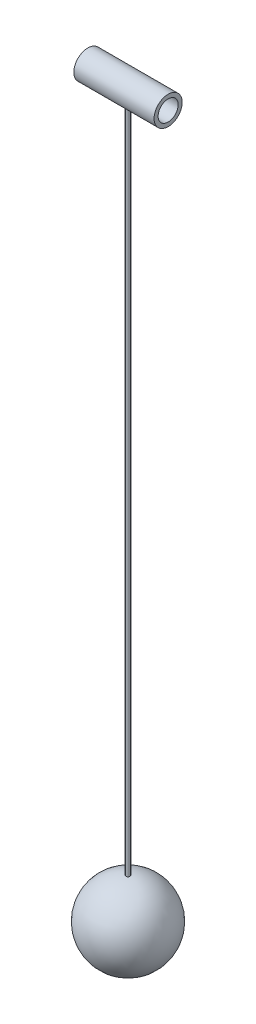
ISO-10303-21;
HEADER;
FILE_DESCRIPTION(('STEP AP214'),'2;1');
FILE_NAME('part.step','',(''),(''),'','','');
FILE_SCHEMA(('AUTOMOTIVE_DESIGN { 1 0 10303 214 1 1 1 1 }'));
ENDSEC;
DATA;
#1=APPLICATION_CONTEXT('core data for automotive mechanical design processes');
#2=APPLICATION_PROTOCOL_DEFINITION('international standard','automotive_design',2000,#1);
#3=PRODUCT_CONTEXT('',#1,'mechanical');
#4=PRODUCT('Part','Part','',(#3));
#5=PRODUCT_RELATED_PRODUCT_CATEGORY('part','',(#4));
#6=PRODUCT_DEFINITION_FORMATION('','',#4);
#7=PRODUCT_DEFINITION_CONTEXT('part definition',#1,'design');
#8=PRODUCT_DEFINITION('design','',#6,#7);
#9=PRODUCT_DEFINITION_SHAPE('','',#8);
#10=(LENGTH_UNIT() NAMED_UNIT(*) SI_UNIT(.MILLI.,.METRE.));
#11=(NAMED_UNIT(*) PLANE_ANGLE_UNIT() SI_UNIT($,.RADIAN.));
#12=(NAMED_UNIT(*) SI_UNIT($,.STERADIAN.) SOLID_ANGLE_UNIT());
#13=UNCERTAINTY_MEASURE_WITH_UNIT(LENGTH_MEASURE(1.E-05),#10,'distance_accuracy_value','');
#14=(GEOMETRIC_REPRESENTATION_CONTEXT(3) GLOBAL_UNCERTAINTY_ASSIGNED_CONTEXT((#13)) GLOBAL_UNIT_ASSIGNED_CONTEXT((#10,
#11,#12)) REPRESENTATION_CONTEXT('',''));
#15=CARTESIAN_POINT('',(0.,0.,0.));
#16=DIRECTION('',(0.,0.,1.));
#17=DIRECTION('',(1.,0.,0.));
#18=AXIS2_PLACEMENT_3D('',#15,#16,#17);
#19=CARTESIAN_POINT('',(-68.2995240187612,0.,0.));
#20=DIRECTION('',(-1.,0.,0.));
#21=DIRECTION('',(0.,0.,1.));
#22=AXIS2_PLACEMENT_3D('',#19,#20,#21);
#23=CYLINDRICAL_SURFACE('',#22,3.5);
#24=CARTESIAN_POINT('',(0.,-3.46410161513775,0.5));
#25=CARTESIAN_POINT('',(-0.0279310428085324,-3.4641020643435,0.499998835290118));
#26=CARTESIAN_POINT('',(-0.055878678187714,-3.4644430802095,0.497651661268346));
#27=CARTESIAN_POINT('',(-0.110993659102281,-3.46576949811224,0.488326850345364));
#28=CARTESIAN_POINT('',(-0.138160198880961,-3.4667555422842,0.481344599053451));
#29=CARTESIAN_POINT('',(-0.190907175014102,-3.46925810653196,0.462961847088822));
#30=CARTESIAN_POINT('',(-0.216488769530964,-3.47077423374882,0.451564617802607));
#31=CARTESIAN_POINT('',(-0.26537243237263,-3.47416566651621,0.424682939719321));
#32=CARTESIAN_POINT('',(-0.288674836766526,-3.47604091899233,0.409199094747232));
#33=CARTESIAN_POINT('',(-0.33251207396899,-3.47995456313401,0.374463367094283));
#34=CARTESIAN_POINT('',(-0.35302792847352,-3.48199393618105,0.355187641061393));
#35=CARTESIAN_POINT('',(-0.39054538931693,-3.48599725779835,0.313466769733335));
#36=CARTESIAN_POINT('',(-0.407546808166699,-3.48796120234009,0.291021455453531));
#37=CARTESIAN_POINT('',(-0.437622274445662,-3.49160259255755,0.243477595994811));
#38=CARTESIAN_POINT('',(-0.450678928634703,-3.49327875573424,0.218367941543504));
#39=CARTESIAN_POINT('',(-0.472382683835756,-3.49614487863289,0.166284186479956));
#40=CARTESIAN_POINT('',(-0.481029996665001,-3.49733486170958,0.139310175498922));
#41=CARTESIAN_POINT('',(-0.493612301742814,-3.49908762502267,0.0844585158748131));
#42=CARTESIAN_POINT('',(-0.497579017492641,-3.49965462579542,0.0565882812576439));
#43=CARTESIAN_POINT('',(-0.500785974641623,-3.50011198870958,0.000572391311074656));
#44=CARTESIAN_POINT('',(-0.500026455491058,-3.50000238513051,-0.0275732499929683));
#45=CARTESIAN_POINT('',(-0.493827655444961,-3.499122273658,-0.0831247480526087));
#46=CARTESIAN_POINT('',(-0.488422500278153,-3.4983565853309,-0.110534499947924));
#47=CARTESIAN_POINT('',(-0.473139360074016,-3.49625571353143,-0.164053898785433));
#48=CARTESIAN_POINT('',(-0.46326126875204,-3.4949205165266,-0.1901635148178));
#49=CARTESIAN_POINT('',(-0.439277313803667,-3.4918223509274,-0.240445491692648));
#50=CARTESIAN_POINT('',(-0.425156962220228,-3.49005792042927,-0.264610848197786));
#51=CARTESIAN_POINT('',(-0.393099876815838,-3.48629816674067,-0.310241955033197));
#52=CARTESIAN_POINT('',(-0.375162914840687,-3.48430282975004,-0.331707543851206));
#53=CARTESIAN_POINT('',(-0.335791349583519,-3.48028301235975,-0.371530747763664));
#54=CARTESIAN_POINT('',(-0.314326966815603,-3.47825843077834,-0.389858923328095));
#55=CARTESIAN_POINT('',(-0.268611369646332,-3.47442573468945,-0.422657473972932));
#56=CARTESIAN_POINT('',(-0.244360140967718,-3.47261762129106,-0.437127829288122));
#57=CARTESIAN_POINT('',(-0.193729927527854,-3.46942263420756,-0.461803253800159));
#58=CARTESIAN_POINT('',(-0.16734954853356,-3.46803603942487,-0.472005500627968));
#59=CARTESIAN_POINT('',(-0.113225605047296,-3.46584616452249,-0.487826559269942));
#60=CARTESIAN_POINT('',(-0.0854821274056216,-3.4650428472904,-0.493445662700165));
#61=CARTESIAN_POINT('',(-0.0296808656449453,-3.46411745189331,-0.499900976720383));
#62=CARTESIAN_POINT('',(-0.00162799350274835,-3.46398944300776,-0.500778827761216));
#63=CARTESIAN_POINT('',(0.0542244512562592,-3.46441343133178,-0.497837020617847));
#64=CARTESIAN_POINT('',(0.0820240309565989,-3.46496540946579,-0.494017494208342));
#65=CARTESIAN_POINT('',(0.136453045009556,-3.466681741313,-0.481824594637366));
#66=CARTESIAN_POINT('',(0.163087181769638,-3.46784332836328,-0.473471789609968));
#67=CARTESIAN_POINT('',(0.214577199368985,-3.47064572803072,-0.452470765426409));
#68=CARTESIAN_POINT('',(0.239432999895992,-3.4722865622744,-0.439822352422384));
#69=CARTESIAN_POINT('',(0.286847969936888,-3.47587662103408,-0.410488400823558));
#70=CARTESIAN_POINT('',(0.309390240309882,-3.47782788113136,-0.393775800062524));
#71=CARTESIAN_POINT('',(0.351364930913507,-3.48181272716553,-0.356825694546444));
#72=CARTESIAN_POINT('',(0.370797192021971,-3.48384631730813,-0.336588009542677));
#73=CARTESIAN_POINT('',(0.406148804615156,-3.48778513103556,-0.292979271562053));
#74=CARTESIAN_POINT('',(0.422040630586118,-3.48968927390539,-0.269585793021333));
#75=CARTESIAN_POINT('',(0.449668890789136,-3.49313805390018,-0.220437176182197));
#76=CARTESIAN_POINT('',(0.461405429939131,-3.49468270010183,-0.194682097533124));
#77=CARTESIAN_POINT('',(0.480345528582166,-3.49723369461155,-0.141628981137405));
#78=CARTESIAN_POINT('',(0.487564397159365,-3.4982418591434,-0.114336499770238));
#79=CARTESIAN_POINT('',(0.497313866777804,-3.49961389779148,-0.058911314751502));
#80=CARTESIAN_POINT('',(0.499844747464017,-3.49997781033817,-0.0307786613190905));
#81=CARTESIAN_POINT('',(0.50014005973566,-3.50002001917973,0.0252607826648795));
#82=CARTESIAN_POINT('',(0.497946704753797,-3.49970438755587,0.0531673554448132));
#83=CARTESIAN_POINT('',(0.488945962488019,-3.49843516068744,0.108210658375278));
#84=CARTESIAN_POINT('',(0.482138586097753,-3.49748156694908,0.135347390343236));
#85=CARTESIAN_POINT('',(0.464117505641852,-3.4950430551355,0.188070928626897));
#86=CARTESIAN_POINT('',(0.45290645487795,-3.49355845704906,0.213658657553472));
#87=CARTESIAN_POINT('',(0.426400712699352,-3.49022140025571,0.262596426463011));
#88=CARTESIAN_POINT('',(0.411105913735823,-3.48836893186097,0.285946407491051));
#89=CARTESIAN_POINT('',(0.376713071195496,-3.48448261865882,0.32996048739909));
#90=CARTESIAN_POINT('',(0.357583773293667,-3.48244736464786,0.350600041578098));
#91=CARTESIAN_POINT('',(0.316130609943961,-3.47843555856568,0.388391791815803));
#92=CARTESIAN_POINT('',(0.293805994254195,-3.47645902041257,0.405543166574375));
#93=CARTESIAN_POINT('',(0.24646364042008,-3.47277771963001,0.435948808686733));
#94=CARTESIAN_POINT('',(0.221432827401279,-3.47107438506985,0.449182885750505));
#95=CARTESIAN_POINT('',(0.169491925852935,-3.46814907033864,0.471239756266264));
#96=CARTESIAN_POINT('',(0.142583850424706,-3.46692658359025,0.480067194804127));
#97=CARTESIAN_POINT('',(0.0962908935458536,-3.46538823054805,0.491023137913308));
#98=CARTESIAN_POINT('',(0.0771939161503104,-3.46490825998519,0.494384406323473));
#99=CARTESIAN_POINT('',(0.0387339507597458,-3.46426479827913,0.498873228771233));
#100=CARTESIAN_POINT('',(0.0193709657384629,-3.4641013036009,0.500000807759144));
#101=CARTESIAN_POINT('',(0.,-3.46410161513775,0.5));
#102=B_SPLINE_CURVE_WITH_KNOTS('',3,(#24,#25,#26,#27,#28,#29,#30,#31,#32,#33,#34,#35,#36,#37,
#38,#39,#40,#41,#42,#43,#44,#45,#46,#47,#48,#49,#50,#51,#52,#53,#54,#55,#56,#57,#58,#59,#60,#61,
#62,#63,#64,#65,#66,#67,#68,#69,#70,#71,#72,#73,#74,#75,#76,#77,#78,#79,#80,#81,#82,#83,#84,#85,
#86,#87,#88,#89,#90,#91,#92,#93,#94,#95,#96,#97,#98,#99,#100,#101),.UNSPECIFIED.,.T.,.F.,(4,2,2,
2,2,2,2,2,2,2,2,2,2,2,2,2,2,2,2,2,2,2,2,2,2,2,2,2,2,2,2,2,2,2,2,2,2,2,4),(0.,0.0837223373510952,
0.167528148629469,0.251271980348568,0.335003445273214,0.419279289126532,0.503559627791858,
0.588206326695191,0.672848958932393,0.756914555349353,0.840975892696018,0.924424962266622,
1.00787601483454,1.09161536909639,1.17535973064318,1.2598512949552,1.3443432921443,
1.42889107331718,1.51343347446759,1.59723215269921,1.68102848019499,1.76444775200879,
1.84787078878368,1.93186530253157,2.01586411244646,2.10049480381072,2.18512335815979,
2.26946355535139,2.35379872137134,2.43738343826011,2.52096795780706,2.60450219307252,
2.68803862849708,2.77228587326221,2.85655293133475,2.94124703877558,3.02585167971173,
3.08391612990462,3.1419799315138),.UNSPECIFIED.);
#103=CARTESIAN_POINT('',(0.,-3.46410161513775,0.5));
#104=VERTEX_POINT('',#103);
#105=EDGE_CURVE('E10',#104,#104,#102,.T.);
#106=ORIENTED_EDGE('',*,*,#105,.F.);
#107=EDGE_LOOP('',(#106));
#108=FACE_BOUND('',#107,.T.);
#109=CARTESIAN_POINT('',(9.99999999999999,0.,0.));
#110=DIRECTION('',(-1.,0.,0.));
#111=DIRECTION('',(0.,0.,1.));
#112=AXIS2_PLACEMENT_3D('',#109,#110,#111);
#113=CIRCLE('',#112,3.5);
#114=CARTESIAN_POINT('',(9.99999999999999,0.,3.5));
#115=VERTEX_POINT('',#114);
#116=EDGE_CURVE('E54',#115,#115,#113,.T.);
#117=ORIENTED_EDGE('',*,*,#116,.T.);
#118=EDGE_LOOP('',(#117));
#119=FACE_BOUND('',#118,.T.);
#120=CARTESIAN_POINT('',(-10.,0.,0.));
#121=DIRECTION('',(-1.,0.,0.));
#122=DIRECTION('',(0.,0.,1.));
#123=AXIS2_PLACEMENT_3D('',#120,#121,#122);
#124=CIRCLE('',#123,3.5);
#125=CARTESIAN_POINT('',(-10.,0.,3.5));
#126=VERTEX_POINT('',#125);
#127=EDGE_CURVE('E41',#126,#126,#124,.T.);
#128=ORIENTED_EDGE('',*,*,#127,.F.);
#129=EDGE_LOOP('',(#128));
#130=FACE_BOUND('',#129,.T.);
#131=ADVANCED_FACE('F30',(#108,#119,#130),#23,.T.);
#132=CARTESIAN_POINT('',(-10.,-3.5,0.));
#133=DIRECTION('',(1.,0.,0.));
#134=DIRECTION('',(0.,0.,-1.));
#135=AXIS2_PLACEMENT_3D('',#132,#133,#134);
#136=PLANE('',#135);
#137=CARTESIAN_POINT('',(-10.,0.,0.));
#138=DIRECTION('',(-1.,0.,0.));
#139=DIRECTION('',(0.,0.,1.));
#140=AXIS2_PLACEMENT_3D('',#137,#138,#139);
#141=CIRCLE('',#140,2.5);
#142=CARTESIAN_POINT('',(-10.,0.,2.5));
#143=VERTEX_POINT('',#142);
#144=EDGE_CURVE('E45',#143,#143,#141,.T.);
#145=ORIENTED_EDGE('',*,*,#144,.F.);
#146=EDGE_LOOP('',(#145));
#147=FACE_BOUND('',#146,.T.);
#148=ORIENTED_EDGE('',*,*,#127,.T.);
#149=EDGE_LOOP('',(#148));
#150=FACE_BOUND('',#149,.T.);
#151=ADVANCED_FACE('F76',(#147,#150),#136,.F.);
#152=CARTESIAN_POINT('',(-68.2995240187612,0.,0.));
#153=DIRECTION('',(-1.,0.,0.));
#154=DIRECTION('',(0.,0.,1.));
#155=AXIS2_PLACEMENT_3D('',#152,#153,#154);
#156=CYLINDRICAL_SURFACE('',#155,2.5);
#157=CARTESIAN_POINT('',(9.99999999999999,0.,0.));
#158=DIRECTION('',(-1.,0.,0.));
#159=DIRECTION('',(0.,0.,1.));
#160=AXIS2_PLACEMENT_3D('',#157,#158,#159);
#161=CIRCLE('',#160,2.5);
#162=CARTESIAN_POINT('',(9.99999999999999,0.,2.5));
#163=VERTEX_POINT('',#162);
#164=EDGE_CURVE('E49',#163,#163,#161,.T.);
#165=ORIENTED_EDGE('',*,*,#164,.F.);
#166=EDGE_LOOP('',(#165));
#167=FACE_BOUND('',#166,.T.);
#168=ORIENTED_EDGE('',*,*,#144,.T.);
#169=EDGE_LOOP('',(#168));
#170=FACE_BOUND('',#169,.T.);
#171=ADVANCED_FACE('F71',(#167,#170),#156,.F.);
#172=CARTESIAN_POINT('',(10.,-2.5,0.));
#173=DIRECTION('',(-1.,0.,0.));
#174=DIRECTION('',(0.,0.,1.));
#175=AXIS2_PLACEMENT_3D('',#172,#173,#174);
#176=PLANE('',#175);
#177=ORIENTED_EDGE('',*,*,#116,.F.);
#178=EDGE_LOOP('',(#177));
#179=FACE_BOUND('',#178,.T.);
#180=ORIENTED_EDGE('',*,*,#164,.T.);
#181=EDGE_LOOP('',(#180));
#182=FACE_BOUND('',#181,.T.);
#183=ADVANCED_FACE('F65',(#179,#182),#176,.F.);
#184=CARTESIAN_POINT('',(0.,-500000.,0.));
#185=DIRECTION('',(0.,1.,0.));
#186=DIRECTION('',(0.,0.,1.));
#187=AXIS2_PLACEMENT_3D('',#184,#185,#186);
#188=CYLINDRICAL_SURFACE('',#187,0.5);
#189=CARTESIAN_POINT('',(0.,-170.012507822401,0.));
#190=DIRECTION('',(0.,-1.,0.));
#191=DIRECTION('',(0.,0.,-1.));
#192=AXIS2_PLACEMENT_3D('',#189,#190,#191);
#193=CIRCLE('',#192,0.5);
#194=CARTESIAN_POINT('',(0.,-170.012507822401,-0.5));
#195=VERTEX_POINT('',#194);
#196=EDGE_CURVE('E57',#195,#195,#193,.T.);
#197=ORIENTED_EDGE('',*,*,#196,.F.);
#198=EDGE_LOOP('',(#197));
#199=FACE_BOUND('',#198,.T.);
#200=ORIENTED_EDGE('',*,*,#105,.T.);
#201=EDGE_LOOP('',(#200));
#202=FACE_BOUND('',#201,.T.);
#203=ADVANCED_FACE('F63',(#199,#202),#188,.T.);
#204=CARTESIAN_POINT('',(0.,-180.,0.));
#205=DIRECTION('',(0.,1.,0.));
#206=DIRECTION('',(-1.,0.,0.));
#207=AXIS2_PLACEMENT_3D('',#204,#205,#206);
#208=SPHERICAL_SURFACE('',#207,10.);
#209=ORIENTED_EDGE('',*,*,#196,.T.);
#210=EDGE_LOOP('',(#209));
#211=FACE_BOUND('',#210,.T.);
#212=ADVANCED_FACE('F61',(#211),#208,.T.);
#213=CLOSED_SHELL('',(#131,#151,#171,#183,#203,#212));
#214=MANIFOLD_SOLID_BREP('B2',#213);
#215=ADVANCED_BREP_SHAPE_REPRESENTATION('',(#18,#214),#14);
#216=SHAPE_DEFINITION_REPRESENTATION(#9,#215);
ENDSEC;
END-ISO-10303-21;
